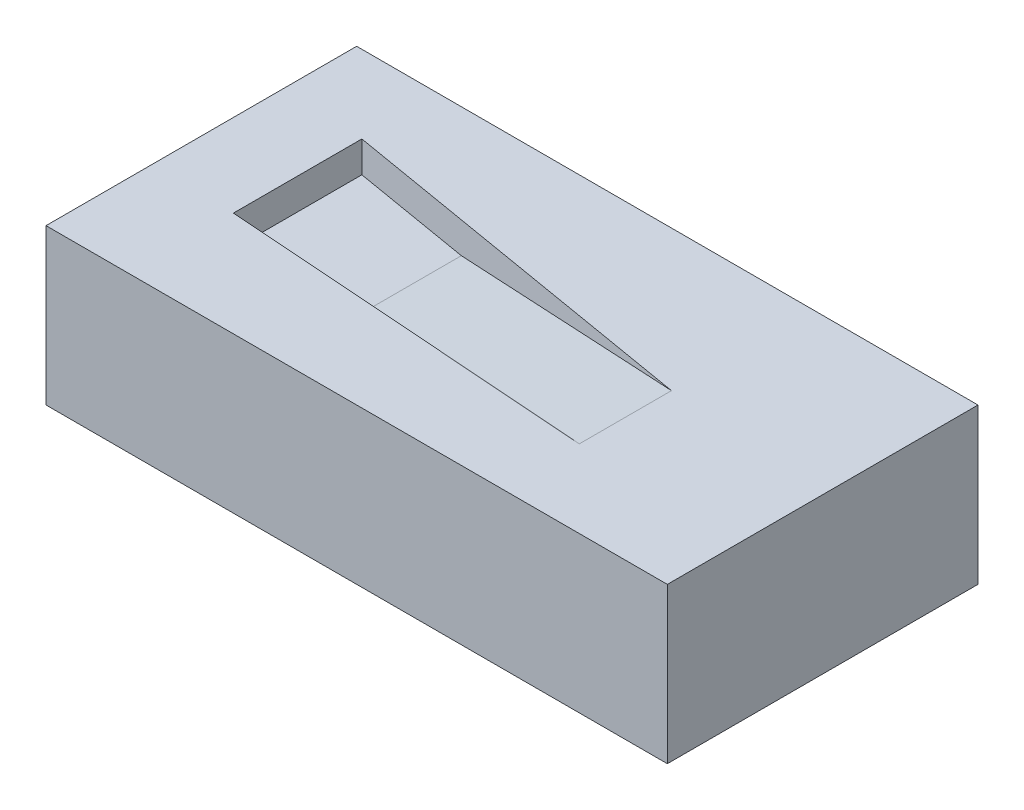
from build123d import *

# Parameters (mm, degrees)
SKIZZE1_W                       = 120
SKIZZE1_H                       = 30
LINEAR_AUSTRAGEN1_DEPTH         = 60
SCHNITT_LINEAR_START            = -15
SCHNITT_LINEAR_AUSTRAGEN1_DEPTH = 30
LINEAR_AUSTRAGEN2_DEPTH         = 6


with BuildPart() as part:
    # Skizze1 → Linear austragen1 (new body)
    with BuildSketch(Plane.XY):
        with Locations((60, -15)):
            Rectangle(SKIZZE1_W, SKIZZE1_H)
    extrude(amount=-LINEAR_AUSTRAGEN1_DEPTH)

    # Skizze1_3 → Schnitt-Linear austragen1 (cut)
    with BuildSketch(Plane.XY.offset(SCHNITT_LINEAR_START)):
        Polygon((88, 0), (16, 0), (16, -6), (39.133921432, -6), align=None)
    extrude(amount=-SCHNITT_LINEAR_AUSTRAGEN1_DEPTH, mode=Mode.SUBTRACT)

    # Skizze2 → Linear austragen2 (add)
    with BuildSketch(Plane(origin=(0, 0, 0), x_dir=(1, 0, 0), z_dir=(0, 1, 0))):
        Polygon((16, 20.197116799), (88, 15), (16, 15), align=None)
        Polygon((16, 45), (88, 32.800823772), (88, 45), align=None)
    extrude(amount=-LINEAR_AUSTRAGEN2_DEPTH)


solid = part.part
